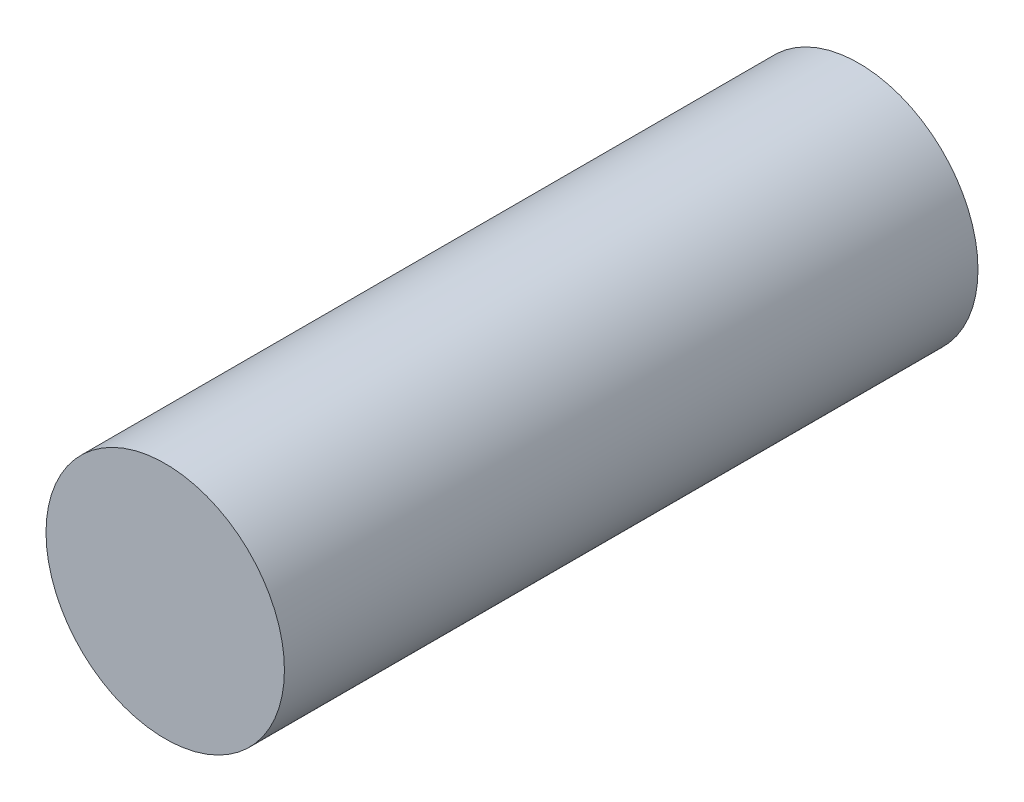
from build123d import *

# Parameters (mm, degrees)
ESQUISSE1_R        = 27.5
BOSS_EXTRU_1_DEPTH = 160


with BuildPart() as part:
    # Esquisse1 → Boss.-Extru.1 (new body)
    with BuildSketch(Plane.XY):
        Circle(ESQUISSE1_R)
    extrude(amount=BOSS_EXTRU_1_DEPTH)


solid = part.part
